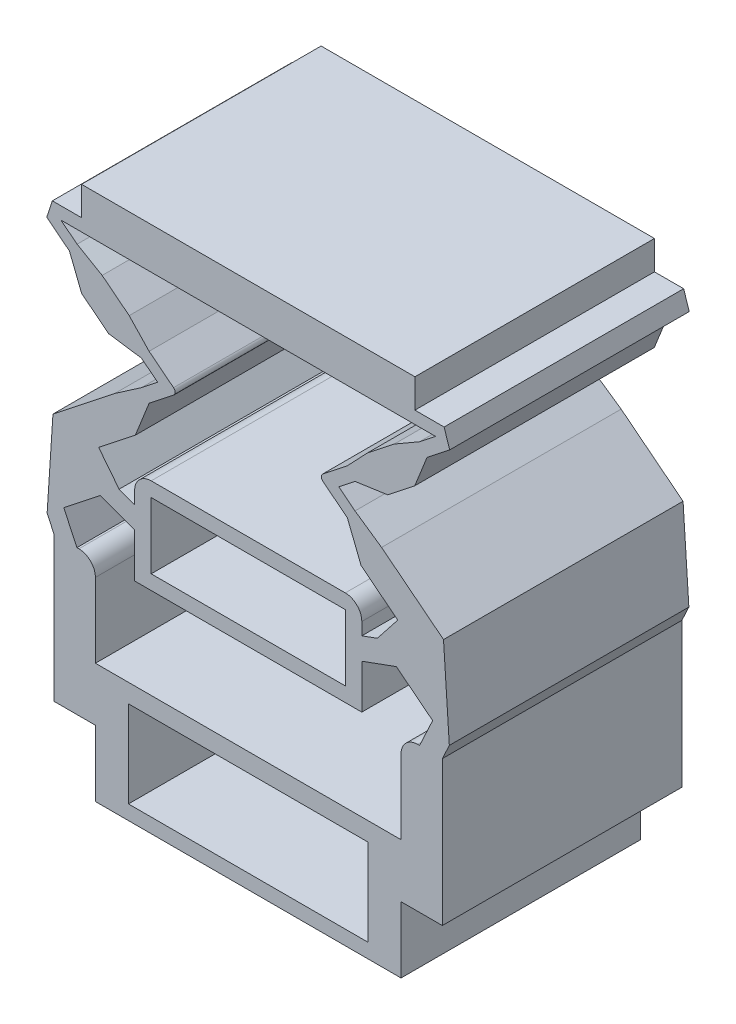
from build123d import *

# Parameters (mm, degrees)
EXTRUDE_1_DEPTH     = 5.8
SKETCH_10_W         = 5.8
SKETCH_10_H         = 2.1
SKETCH_10_W_2       = 4.7
SKETCH_10_H_2       = 1.6
CUT_EXTRUDE_3_DEPTH = 11.469401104
EXTRUDE_2_DEPTH     = 5.8
FILLET_1_R          = 0.4
CUT_EXTRUDE_4_DEPTH = 11.469401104
SKETCH_14_W         = 5.8
SKETCH_14_H         = 0.1
SKETCH_14_W_2       = 7.4
EXTRUDE_4_DEPTH     = 5.8
SKETCH_15_W         = 5.8
SKETCH_15_H         = 0.1
CUT_EXTRUDE_5_DEPTH = 10.938442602
EXTRUDE_3_DEPTH     = 5.8
FILLET_2_R          = 0.4
FILLET_3_R          = 0.1


with BuildPart() as part:
    # Sketch 1 → Extrude 1 (new body)
    with BuildSketch(Plane.XY):
        Polygon((2.75, 5.2), (3.125877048, 5.336808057), (3.992639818, 6.436227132), (5.877358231, 4.950348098), (5.010595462, 3.850929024), (4.869047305, 3.962523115), (4.7, 3.6), (4.7, 0.1), (3.7, 0.1), (3.7, -1.4), (-3.7, -1.4), (-3.7, 1.4), (3.7, 1.4), (3.7, 3.6), (4.148311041, 3.6), (4.465656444, 4.280549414), (3.587618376, 4.97277927), (2.75, 4.667911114), (2.75, 3.6), (-2.75, 3.6), (-2.75, 5.2), align=None)
    extrude_1 = extrude(amount=EXTRUDE_1_DEPTH)

    # Mirror 1: Extrude 1 across plane
    add(extrude_1.mirror(Plane(origin=(0, 0, 0), x_dir=(0, 0, 1), z_dir=(1, 0, 0))))

    # Sketch 10 → Cut-Extrude 3 (cut, through all)
    with BuildSketch(Plane.XY.offset(5.8)):
        Rectangle(SKETCH_10_W, SKETCH_10_H)
        with Locations((0, 4.75)):
            Rectangle(SKETCH_10_W_2, SKETCH_10_H_2)
    extrude(amount=-CUT_EXTRUDE_3_DEPTH, mode=Mode.SUBTRACT)

    # Sketch 11 → Extrude 2 (add)
    with BuildSketch(Plane.XY.offset(5.8)):
        Polygon((-2.35, 5.2), (-2.75, 5.2), (-2.75, 5.9), (2.75, 5.9), (2.75, 5.2), (2.35, 5.2), (2.35, 5.55), (-2.35, 5.55), align=None)
    extrude(amount=-EXTRUDE_2_DEPTH)

    # Fillet 1
    fillet_1_edges = [part.edges().sort_by_distance(p)[0] for p in [
        (2.75, 5.9, 2.9),
        (-2.75, 5.9, 2.9),
    ]]
    fillet(fillet_1_edges, radius=FILLET_1_R)

    # Sketch 13 → Cut-Extrude 4 (cut, through all)
    with BuildSketch(Plane.XY.offset(5.8)):
        Polygon((-4.869047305, 3.962523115), (-4.745888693, 5.842378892), (-5.877358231, 4.950348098), (-5.010595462, 3.850929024), align=None)
        Polygon((4.869047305, 3.962523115), (5.010595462, 3.850929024), (5.877358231, 4.950348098), (4.745888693, 5.842378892), align=None)
    extrude(amount=-CUT_EXTRUDE_4_DEPTH, mode=Mode.SUBTRACT)

    # Sketch 14 → Extrude 4 (add)
    with BuildSketch(Plane.XY.offset(5.8)):
        with Locations((0, 1)):
            Rectangle(SKETCH_14_W, SKETCH_14_H)
        with Locations((0, -1.45)):
            Rectangle(SKETCH_14_W_2, SKETCH_14_H)
    extrude(amount=-EXTRUDE_4_DEPTH)

    # Sketch 15 → Cut-Extrude 5 (cut, through all)
    with BuildSketch(Plane.XY.offset(5.8)):
        with Locations((0, -1.1)):
            Rectangle(SKETCH_15_W, SKETCH_15_H)
    extrude(amount=-CUT_EXTRUDE_5_DEPTH, mode=Mode.SUBTRACT)

    # Sketch 12 → Extrude 3 (add)
    with BuildSketch(Plane.XY.offset(5.8)):
        Polygon((-2.585792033, 7.736371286), (-2.193142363, 8.045929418), (-2.585792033, 8.35548755), (-3.37750988, 8.470304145), (-4.032318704, 8.98654397), (-4.32874354, 9.729600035), (-4.878453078, 10.16298142), (-4.74265986, 10.574747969), (-4.035658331, 10.574747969), (-4.035658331, 11.274747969), (4.035658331, 11.274747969), (4.035658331, 10.574747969), (4.74265986, 10.574747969), (4.878453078, 10.16298142), (4.32874354, 9.729600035), (4.032318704, 8.98654397), (3.37750988, 8.470304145), (2.585792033, 8.35548755), (2.193142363, 8.045929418), (2.585792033, 7.736371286), (3.228828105, 7.293082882), (4.728294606, 6.110929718), (4.745888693, 5.842378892), (3.992639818, 6.436227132), (3.62117006, 5.965047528), (2.733535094, 6.664843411), (2.400057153, 7.500781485), (1.708580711, 8.045929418), (2.400057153, 8.591077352), (2.882216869, 9.098543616), (3.537025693, 9.614783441), (4.143008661, 9.965189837), (4.535658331, 10.274747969), (4.035658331, 10.274747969), (-4.035658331, 10.274747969), (-4.535658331, 10.274747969), (-4.143008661, 9.965189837), (-3.537025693, 9.614783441), (-2.882216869, 9.098543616), (-2.400057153, 8.591077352), (-1.708580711, 8.045929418), (-2.400057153, 7.500781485), (-2.733535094, 6.664843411), (-3.62117006, 5.965047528), (-3.992639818, 6.436227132), (-4.745888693, 5.842378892), (-4.728294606, 6.110929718), (-3.228828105, 7.293082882), align=None)
    extrude(amount=-EXTRUDE_3_DEPTH)

    # Fillet 2
    fillet_2_edges = [part.edges().sort_by_distance(p)[0] for p in [
        (3.7, 3.6, 2.9),
        (-3.7, 3.6, 2.9),
    ]]
    fillet(fillet_2_edges, radius=FILLET_2_R)

    # Fillet 3
    fillet_3_edges = [part.edges().sort_by_distance(p)[0] for p in [
        (-1.708580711, 8.045929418, 2.9),
        (1.708580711, 8.045929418, 2.9),
    ]]
    fillet(fillet_3_edges, radius=FILLET_3_R)


solid = part.part
